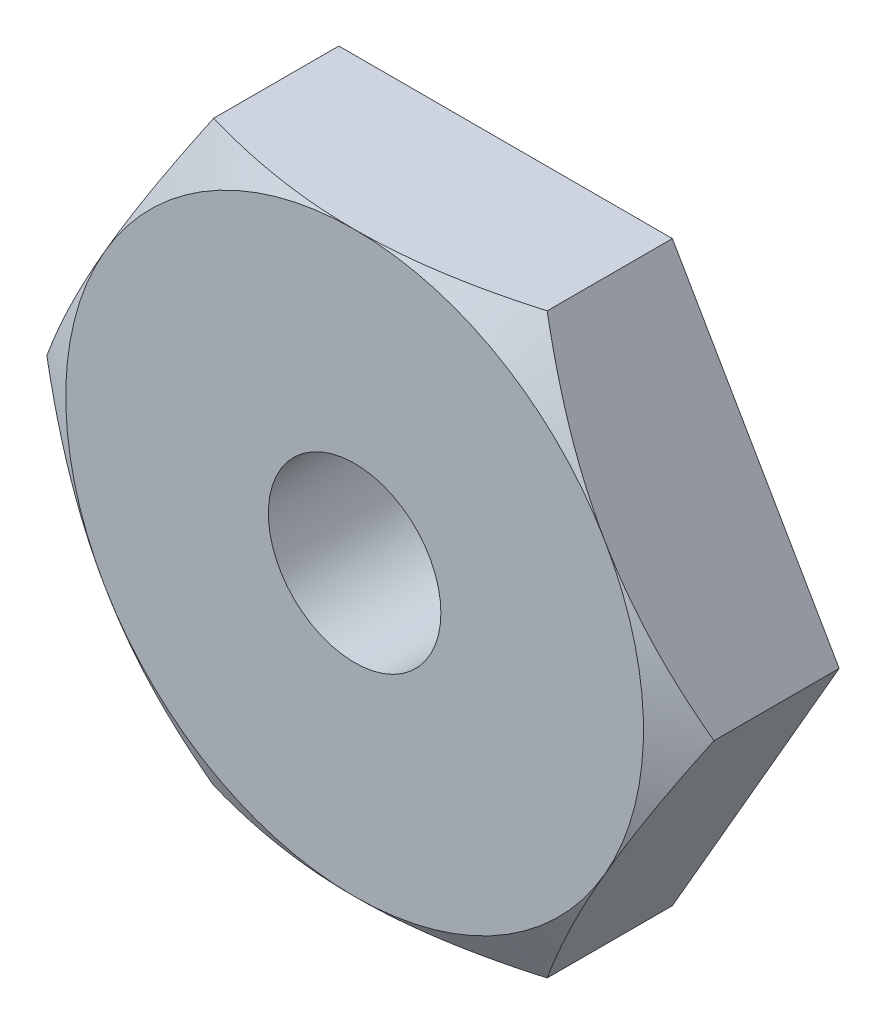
from build123d import *

# Parameters (mm, degrees)
SKETCH1_R          = 1.4224
BASE_EXTRUDE_DEPTH = 2.4892


with BuildPart() as part:
    # Sketch1 → Base-Extrude (new body)
    with BuildSketch(Plane.XY):
        Polygon((-2.749630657, 4.7625), (2.749630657, 4.7625), (5.499261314, 0), (2.749630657, -4.7625), (-2.749630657, -4.7625), (-5.499261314, 0), align=None)
        Circle(SKETCH1_R, mode=Mode.SUBTRACT)
    extrude(amount=BASE_EXTRUDE_DEPTH)

    # Sketch3 → Cut-Revolve2 (revolve, cut)
    with BuildSketch(Plane(origin=(0, 0, 0), x_dir=(1, 0, 0), z_dir=(0, 1, 0))):
        Polygon((-4.7625, -2.4892), (-5.499261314, -2.4892), (-5.499261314, -2.063830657), align=None)
    revolve(axis=Axis((0, 0, 5.08), (0, 0, -1)), mode=Mode.SUBTRACT)


solid = part.part
